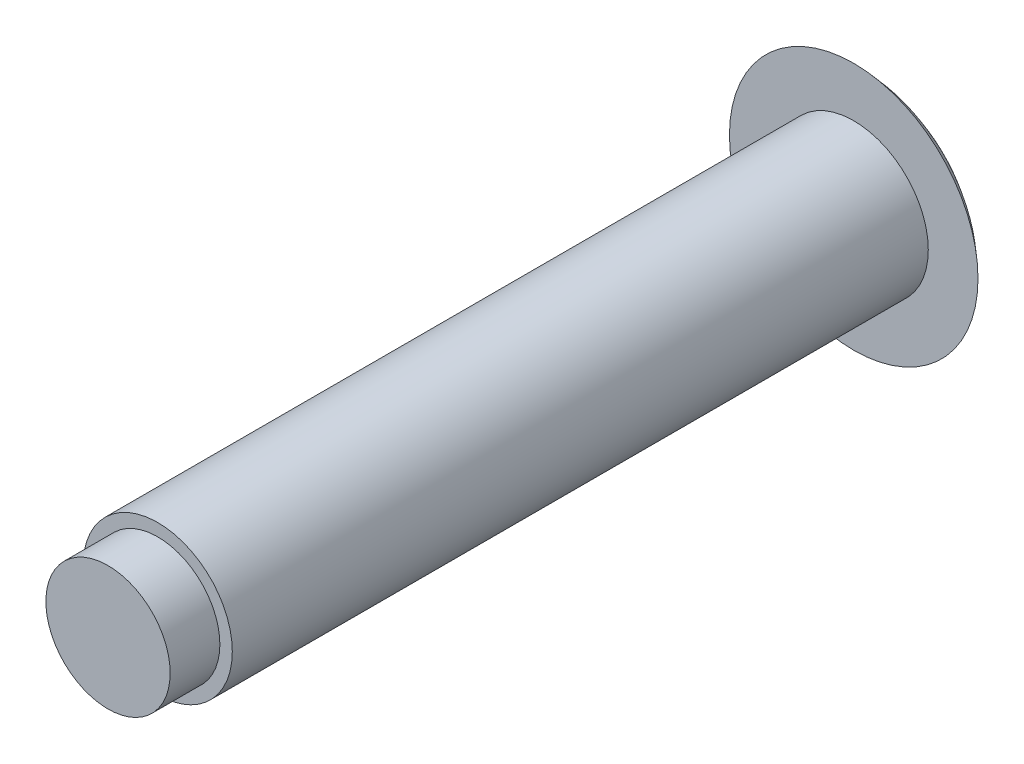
from build123d import *

# Parameters (mm, degrees)
ESQUISSE1_R      = 3
EXTRUSION1_DEPTH = 28
ESQUISSE3_R      = 2.5
EXTRUSION2_DEPTH = 2


with BuildPart() as part:
    # Esquisse1 → Extrusion1 (new body)
    with BuildSketch(Plane.XY):
        Circle(ESQUISSE1_R)
    extrude(amount=EXTRUSION1_DEPTH)

    # Esquisse2 → R_volution1 (revolve)
    with BuildSketch(Plane(origin=(0, 0, 0), x_dir=(1, 0, 0), z_dir=(0, 1, 0))):
        with BuildLine():
            Line((0, 0), (0, 2))
            ThreePointArc((0, 2), (2.692582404, 1.481456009), (5, 0))
            Line((5, 0), (0, 0))
        make_face()
    revolve(axis=Axis((0, 0, 0), (0, 0, -1)))

    # Esquisse3 → Extrusion2 (add)
    with BuildSketch(Plane.XY.offset(28)):
        Circle(ESQUISSE3_R)
    extrude(amount=EXTRUSION2_DEPTH)


solid = part.part
